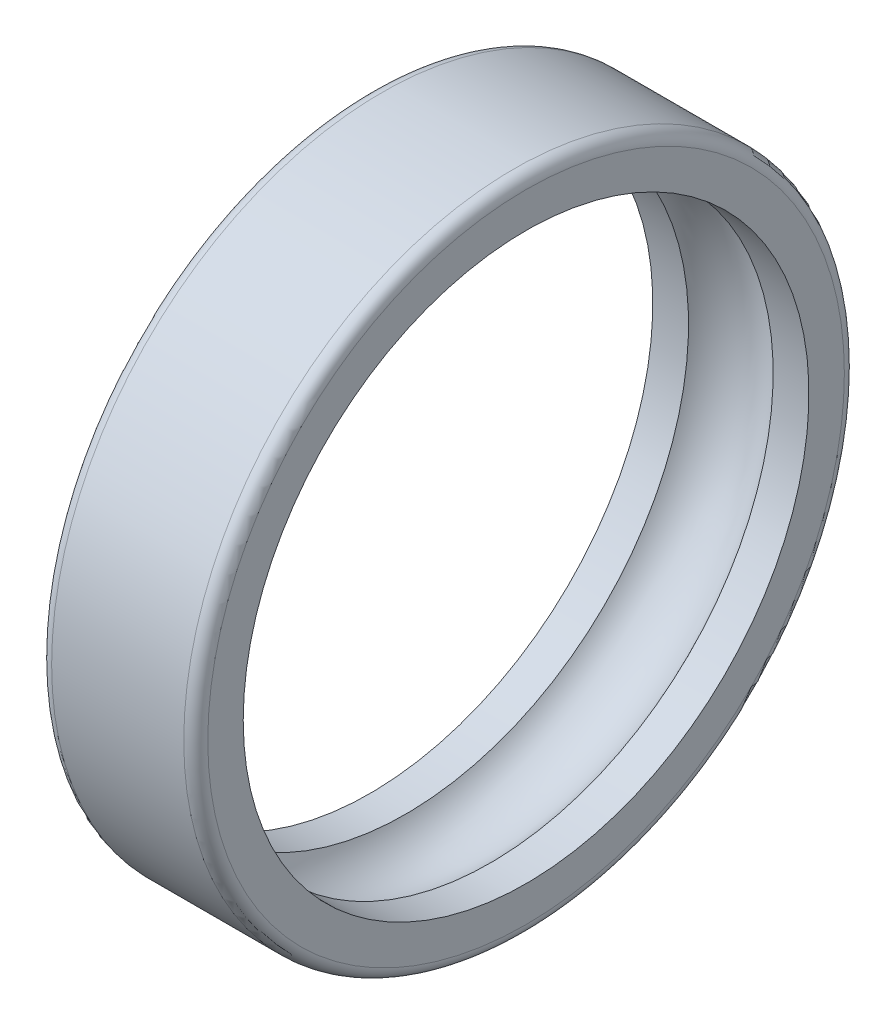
ISO-10303-21;
HEADER;
FILE_DESCRIPTION(('STEP AP214'),'2;1');
FILE_NAME('part.step','',(''),(''),'','','');
FILE_SCHEMA(('AUTOMOTIVE_DESIGN { 1 0 10303 214 1 1 1 1 }'));
ENDSEC;
DATA;
#1=APPLICATION_CONTEXT('core data for automotive mechanical design processes');
#2=APPLICATION_PROTOCOL_DEFINITION('international standard','automotive_design',2000,#1);
#3=PRODUCT_CONTEXT('',#1,'mechanical');
#4=PRODUCT('Part','Part','',(#3));
#5=PRODUCT_RELATED_PRODUCT_CATEGORY('part','',(#4));
#6=PRODUCT_DEFINITION_FORMATION('','',#4);
#7=PRODUCT_DEFINITION_CONTEXT('part definition',#1,'design');
#8=PRODUCT_DEFINITION('design','',#6,#7);
#9=PRODUCT_DEFINITION_SHAPE('','',#8);
#10=(LENGTH_UNIT() NAMED_UNIT(*) SI_UNIT(.MILLI.,.METRE.));
#11=(NAMED_UNIT(*) PLANE_ANGLE_UNIT() SI_UNIT($,.RADIAN.));
#12=(NAMED_UNIT(*) SI_UNIT($,.STERADIAN.) SOLID_ANGLE_UNIT());
#13=UNCERTAINTY_MEASURE_WITH_UNIT(LENGTH_MEASURE(1.E-05),#10,'distance_accuracy_value','');
#14=(GEOMETRIC_REPRESENTATION_CONTEXT(3) GLOBAL_UNCERTAINTY_ASSIGNED_CONTEXT((#13)) GLOBAL_UNIT_ASSIGNED_CONTEXT((#10,
#11,#12)) REPRESENTATION_CONTEXT('',''));
#15=CARTESIAN_POINT('',(0.,0.,0.));
#16=DIRECTION('',(0.,0.,1.));
#17=DIRECTION('',(1.,0.,0.));
#18=AXIS2_PLACEMENT_3D('',#15,#16,#17);
#19=CARTESIAN_POINT('',(0.,26.5,0.));
#20=DIRECTION('',(1.,0.,0.));
#21=DIRECTION('',(0.,0.,-1.));
#22=AXIS2_PLACEMENT_3D('',#19,#20,#21);
#23=PLANE('',#22);
#24=CARTESIAN_POINT('',(0.,0.,0.));
#25=DIRECTION('',(-1.,0.,0.));
#26=DIRECTION('',(0.,0.,1.));
#27=AXIS2_PLACEMENT_3D('',#24,#25,#26);
#28=CIRCLE('',#27,23.55);
#29=CARTESIAN_POINT('',(0.,0.,23.55));
#30=VERTEX_POINT('',#29);
#31=EDGE_CURVE('E10',#30,#30,#28,.T.);
#32=ORIENTED_EDGE('',*,*,#31,.F.);
#33=EDGE_LOOP('',(#32));
#34=FACE_BOUND('',#33,.T.);
#35=CARTESIAN_POINT('',(0.,0.,0.));
#36=DIRECTION('',(-1.,0.,0.));
#37=DIRECTION('',(0.,0.,1.));
#38=AXIS2_PLACEMENT_3D('',#35,#36,#37);
#39=CIRCLE('',#38,26.5);
#40=CARTESIAN_POINT('',(0.,0.,26.5));
#41=VERTEX_POINT('',#40);
#42=EDGE_CURVE('E56',#41,#41,#39,.T.);
#43=ORIENTED_EDGE('',*,*,#42,.T.);
#44=EDGE_LOOP('',(#43));
#45=FACE_BOUND('',#44,.T.);
#46=ADVANCED_FACE('F14',(#34,#45),#23,.F.);
#47=CARTESIAN_POINT('',(0.,0.,0.));
#48=DIRECTION('',(-1.,0.,0.));
#49=DIRECTION('',(0.,0.,1.));
#50=AXIS2_PLACEMENT_3D('',#47,#48,#49);
#51=CYLINDRICAL_SURFACE('',#50,23.55);
#52=CARTESIAN_POINT('',(2.97714801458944,0.,0.));
#53=DIRECTION('',(-1.,0.,0.));
#54=DIRECTION('',(0.,0.,1.));
#55=AXIS2_PLACEMENT_3D('',#52,#53,#54);
#56=CIRCLE('',#55,23.55);
#57=CARTESIAN_POINT('',(2.97714801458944,0.,23.55));
#58=VERTEX_POINT('',#57);
#59=EDGE_CURVE('E21',#58,#58,#56,.T.);
#60=ORIENTED_EDGE('',*,*,#59,.F.);
#61=EDGE_LOOP('',(#60));
#62=FACE_BOUND('',#61,.T.);
#63=ORIENTED_EDGE('',*,*,#31,.T.);
#64=EDGE_LOOP('',(#63));
#65=FACE_BOUND('',#64,.T.);
#66=ADVANCED_FACE('F94',(#62,#65),#51,.F.);
#67=CARTESIAN_POINT('',(6.5,0.,0.));
#68=DIRECTION('',(-1.,0.,0.));
#69=DIRECTION('',(0.,0.,1.));
#70=AXIS2_PLACEMENT_3D('',#67,#68,#69);
#71=TOROIDAL_SURFACE('',#70,21.325,4.16666666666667);
#72=ORIENTED_EDGE('',*,*,#59,.T.);
#73=EDGE_LOOP('',(#72));
#74=FACE_BOUND('',#73,.T.);
#75=CARTESIAN_POINT('',(10.0228519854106,0.,0.));
#76=DIRECTION('',(-1.,0.,0.));
#77=DIRECTION('',(0.,0.,1.));
#78=AXIS2_PLACEMENT_3D('',#75,#76,#77);
#79=CIRCLE('',#78,23.55);
#80=CARTESIAN_POINT('',(10.0228519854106,0.,23.55));
#81=VERTEX_POINT('',#80);
#82=EDGE_CURVE('E30',#81,#81,#79,.T.);
#83=ORIENTED_EDGE('',*,*,#82,.F.);
#84=EDGE_LOOP('',(#83));
#85=FACE_BOUND('',#84,.T.);
#86=ADVANCED_FACE('F89',(#74,#85),#71,.F.);
#87=CARTESIAN_POINT('',(0.,0.,0.));
#88=DIRECTION('',(-1.,0.,0.));
#89=DIRECTION('',(0.,0.,1.));
#90=AXIS2_PLACEMENT_3D('',#87,#88,#89);
#91=CYLINDRICAL_SURFACE('',#90,23.55);
#92=CARTESIAN_POINT('',(13.,0.,0.));
#93=DIRECTION('',(-1.,0.,0.));
#94=DIRECTION('',(0.,0.,1.));
#95=AXIS2_PLACEMENT_3D('',#92,#93,#94);
#96=CIRCLE('',#95,23.55);
#97=CARTESIAN_POINT('',(13.,0.,23.55));
#98=VERTEX_POINT('',#97);
#99=EDGE_CURVE('E38',#98,#98,#96,.T.);
#100=ORIENTED_EDGE('',*,*,#99,.F.);
#101=EDGE_LOOP('',(#100));
#102=FACE_BOUND('',#101,.T.);
#103=ORIENTED_EDGE('',*,*,#82,.T.);
#104=EDGE_LOOP('',(#103));
#105=FACE_BOUND('',#104,.T.);
#106=ADVANCED_FACE('F83',(#102,#105),#91,.F.);
#107=CARTESIAN_POINT('',(13.,23.55,0.));
#108=DIRECTION('',(-1.,0.,0.));
#109=DIRECTION('',(0.,0.,1.));
#110=AXIS2_PLACEMENT_3D('',#107,#108,#109);
#111=PLANE('',#110);
#112=CARTESIAN_POINT('',(13.,0.,0.));
#113=DIRECTION('',(-1.,0.,0.));
#114=DIRECTION('',(0.,0.,1.));
#115=AXIS2_PLACEMENT_3D('',#112,#113,#114);
#116=CIRCLE('',#115,26.5);
#117=CARTESIAN_POINT('',(13.,0.,26.5));
#118=VERTEX_POINT('',#117);
#119=EDGE_CURVE('E44',#118,#118,#116,.T.);
#120=ORIENTED_EDGE('',*,*,#119,.F.);
#121=EDGE_LOOP('',(#120));
#122=FACE_BOUND('',#121,.T.);
#123=ORIENTED_EDGE('',*,*,#99,.T.);
#124=EDGE_LOOP('',(#123));
#125=FACE_BOUND('',#124,.T.);
#126=ADVANCED_FACE('F77',(#122,#125),#111,.F.);
#127=CARTESIAN_POINT('',(12.,0.,0.));
#128=DIRECTION('',(-1.,0.,0.));
#129=DIRECTION('',(0.,0.,1.));
#130=AXIS2_PLACEMENT_3D('',#127,#128,#129);
#131=TOROIDAL_SURFACE('',#130,26.5,1.);
#132=CARTESIAN_POINT('',(12.,0.,0.));
#133=DIRECTION('',(-1.,0.,0.));
#134=DIRECTION('',(0.,0.,1.));
#135=AXIS2_PLACEMENT_3D('',#132,#133,#134);
#136=CIRCLE('',#135,27.5);
#137=CARTESIAN_POINT('',(12.,0.,27.5));
#138=VERTEX_POINT('',#137);
#139=EDGE_CURVE('E48',#138,#138,#136,.T.);
#140=ORIENTED_EDGE('',*,*,#139,.F.);
#141=EDGE_LOOP('',(#140));
#142=FACE_BOUND('',#141,.T.);
#143=ORIENTED_EDGE('',*,*,#119,.T.);
#144=EDGE_LOOP('',(#143));
#145=FACE_BOUND('',#144,.T.);
#146=ADVANCED_FACE('F71',(#142,#145),#131,.T.);
#147=CARTESIAN_POINT('',(0.,0.,0.));
#148=DIRECTION('',(-1.,0.,0.));
#149=DIRECTION('',(0.,0.,1.));
#150=AXIS2_PLACEMENT_3D('',#147,#148,#149);
#151=CYLINDRICAL_SURFACE('',#150,27.5);
#152=CARTESIAN_POINT('',(1.,0.,0.));
#153=DIRECTION('',(-1.,0.,0.));
#154=DIRECTION('',(0.,0.,1.));
#155=AXIS2_PLACEMENT_3D('',#152,#153,#154);
#156=CIRCLE('',#155,27.5);
#157=CARTESIAN_POINT('',(1.,0.,27.5));
#158=VERTEX_POINT('',#157);
#159=EDGE_CURVE('E52',#158,#158,#156,.T.);
#160=ORIENTED_EDGE('',*,*,#159,.F.);
#161=EDGE_LOOP('',(#160));
#162=FACE_BOUND('',#161,.T.);
#163=ORIENTED_EDGE('',*,*,#139,.T.);
#164=EDGE_LOOP('',(#163));
#165=FACE_BOUND('',#164,.T.);
#166=ADVANCED_FACE('F65',(#162,#165),#151,.T.);
#167=CARTESIAN_POINT('',(1.,0.,0.));
#168=DIRECTION('',(-1.,0.,0.));
#169=DIRECTION('',(0.,0.,1.));
#170=AXIS2_PLACEMENT_3D('',#167,#168,#169);
#171=TOROIDAL_SURFACE('',#170,26.5,1.);
#172=ORIENTED_EDGE('',*,*,#42,.F.);
#173=EDGE_LOOP('',(#172));
#174=FACE_BOUND('',#173,.T.);
#175=ORIENTED_EDGE('',*,*,#159,.T.);
#176=EDGE_LOOP('',(#175));
#177=FACE_BOUND('',#176,.T.);
#178=ADVANCED_FACE('F62',(#174,#177),#171,.T.);
#179=CLOSED_SHELL('',(#46,#66,#86,#106,#126,#146,#166,#178));
#180=MANIFOLD_SOLID_BREP('B1',#179);
#181=ADVANCED_BREP_SHAPE_REPRESENTATION('',(#18,#180),#14);
#182=SHAPE_DEFINITION_REPRESENTATION(#9,#181);
ENDSEC;
END-ISO-10303-21;
